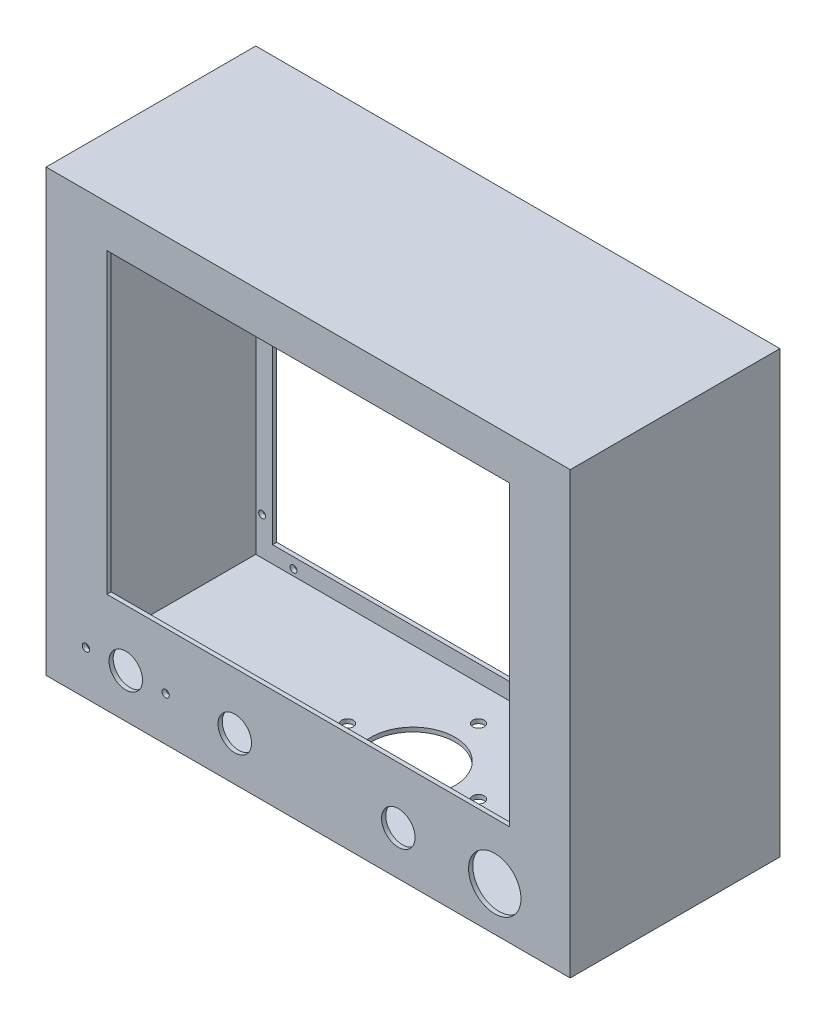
from build123d import *

# Parameters (mm, degrees)
SKETCH_1_W          = 250
SKETCH_1_H          = 210
EXTRUDE_1_DEPTH     = 100
SHELL_1_T           = 2
SKETCH_2_W          = 192
SKETCH_2_H          = 142
CUT_EXTRUDE_1_DEPTH = 2
SKETCH_3_R          = 1.75
SKETCH_3_R_2        = 8
SKETCH_3_R_3        = 12.5
CUT_EXTRUDE_2_DEPTH = 2
SKETCH_4_W          = 230
SKETCH_4_H          = 190
CUT_EXTRUDE_3_DEPTH = 2
SKETCH_5_R          = 1.65
CUT_EXTRUDE_4_DEPTH = 2
SKETCH_8_R          = 20
SKETCH_8_R_2        = 2.75
CUT_EXTRUDE_5_DEPTH = 2


with BuildPart() as part:
    # Sketch 1 → Extrude 1 (new body)
    with BuildSketch(Plane.XY):
        with Locations((125, 105)):
            Rectangle(SKETCH_1_W, SKETCH_1_H)
    extrude(amount=EXTRUDE_1_DEPTH)

    # Shell 1 (no face opened: a closed hollow body)
    add(offset(amount=-SHELL_1_T, mode=Mode.PRIVATE), mode=Mode.SUBTRACT)

    # Sketch 2 → Cut-Extrude 1 (cut)
    with BuildSketch(Plane.XY.offset(100)):
        with Locations((125, 119)):
            Rectangle(SKETCH_2_W, SKETCH_2_H)
    extrude(amount=-CUT_EXTRUDE_1_DEPTH, mode=Mode.SUBTRACT)

    # Sketch 3 → Cut-Extrude 2 (cut)
    with BuildSketch(Plane.XY.offset(100)):
        with Locations((19, 21)):
            Circle(SKETCH_3_R)
        with Locations((57, 21)):
            Circle(SKETCH_3_R)
        with Locations((90, 21)):
            Circle(SKETCH_3_R_2)
        with Locations((168, 21)):
            Circle(SKETCH_3_R_2)
        with Locations((38, 21)):
            Circle(SKETCH_3_R_2)
        with Locations((214, 21)):
            Circle(SKETCH_3_R_3)
    extrude(amount=-CUT_EXTRUDE_2_DEPTH, mode=Mode.SUBTRACT)

    # Sketch 4 → Cut-Extrude 3 (cut)
    with BuildSketch(Plane.XY.offset(2)):
        with Locations((125, 105)):
            Rectangle(SKETCH_4_W, SKETCH_4_H)
    extrude(amount=-CUT_EXTRUDE_3_DEPTH, mode=Mode.SUBTRACT)

    # Sketch 5 → Cut-Extrude 4 (cut)
    with BuildSketch(Plane.XY.offset(2)):
        with Locations((20, 205)):
            Circle(SKETCH_5_R)
        with Locations((230, 205)):
            Circle(SKETCH_5_R)
        with Locations((245, 190)):
            Circle(SKETCH_5_R)
        with Locations((245, 20)):
            Circle(SKETCH_5_R)
        with Locations((230, 5)):
            Circle(SKETCH_5_R)
        with Locations((20, 5)):
            Circle(SKETCH_5_R)
        with Locations((5, 20)):
            Circle(SKETCH_5_R)
        with Locations((5, 190)):
            Circle(SKETCH_5_R)
    extrude(amount=-CUT_EXTRUDE_4_DEPTH, mode=Mode.SUBTRACT)

    # Sketch 8 → Cut-Extrude 5 (cut)
    with BuildSketch(Plane(origin=(0, 2, 0), x_dir=(1, 0, 0), z_dir=(0, 1, 0))):
        with Locations(Location((125, -50, 0), (0, 0, 270))):
            Circle(SKETCH_8_R)
        with Locations(Location((125, -81.25, 0), (0, 0, 270))):
            Circle(SKETCH_8_R_2)
        with Locations(Location((156.25, -50, 0), (0, 0, 270))):
            Circle(SKETCH_8_R_2)
        with Locations(Location((125, -18.75, 0), (0, 0, 270))):
            Circle(SKETCH_8_R_2)
        with Locations(Location((93.75, -50, 0), (0, 0, 270))):
            Circle(SKETCH_8_R_2)
    extrude(amount=-CUT_EXTRUDE_5_DEPTH, mode=Mode.SUBTRACT)


solid = part.part
